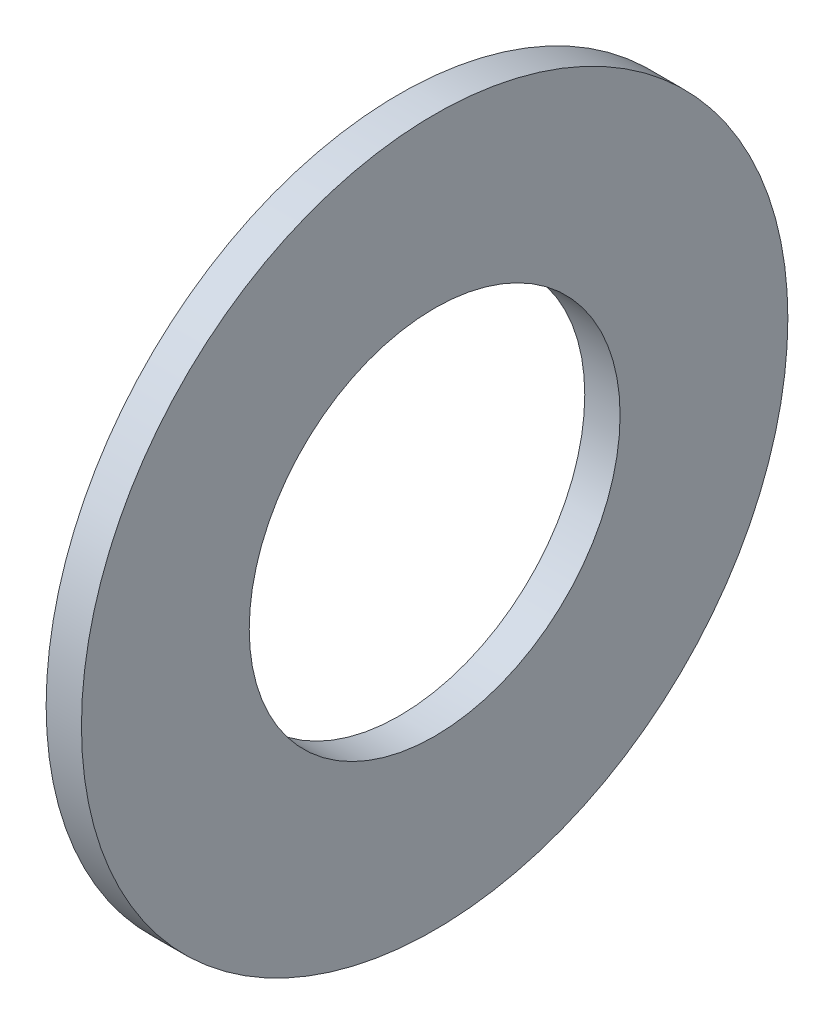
ISO-10303-21;
HEADER;
FILE_DESCRIPTION(('STEP AP214'),'2;1');
FILE_NAME('part.step','',(''),(''),'','','');
FILE_SCHEMA(('AUTOMOTIVE_DESIGN { 1 0 10303 214 1 1 1 1 }'));
ENDSEC;
DATA;
#1=APPLICATION_CONTEXT('core data for automotive mechanical design processes');
#2=APPLICATION_PROTOCOL_DEFINITION('international standard','automotive_design',2000,#1);
#3=PRODUCT_CONTEXT('',#1,'mechanical');
#4=PRODUCT('Part','Part','',(#3));
#5=PRODUCT_RELATED_PRODUCT_CATEGORY('part','',(#4));
#6=PRODUCT_DEFINITION_FORMATION('','',#4);
#7=PRODUCT_DEFINITION_CONTEXT('part definition',#1,'design');
#8=PRODUCT_DEFINITION('design','',#6,#7);
#9=PRODUCT_DEFINITION_SHAPE('','',#8);
#10=(LENGTH_UNIT() NAMED_UNIT(*) SI_UNIT(.MILLI.,.METRE.));
#11=(NAMED_UNIT(*) PLANE_ANGLE_UNIT() SI_UNIT($,.RADIAN.));
#12=(NAMED_UNIT(*) SI_UNIT($,.STERADIAN.) SOLID_ANGLE_UNIT());
#13=UNCERTAINTY_MEASURE_WITH_UNIT(LENGTH_MEASURE(1.E-05),#10,'distance_accuracy_value','');
#14=(GEOMETRIC_REPRESENTATION_CONTEXT(3) GLOBAL_UNCERTAINTY_ASSIGNED_CONTEXT((#13)) GLOBAL_UNIT_ASSIGNED_CONTEXT((#10,
#11,#12)) REPRESENTATION_CONTEXT('',''));
#15=CARTESIAN_POINT('',(0.,0.,0.));
#16=DIRECTION('',(0.,0.,1.));
#17=DIRECTION('',(1.,0.,0.));
#18=AXIS2_PLACEMENT_3D('',#15,#16,#17);
#19=CARTESIAN_POINT('',(0.,0.,-10.));
#20=DIRECTION('',(1.,0.,0.));
#21=DIRECTION('',(0.,0.,-1.));
#22=AXIS2_PLACEMENT_3D('',#19,#20,#21);
#23=PLANE('',#22);
#24=CARTESIAN_POINT('',(0.,0.,0.));
#25=DIRECTION('',(-1.,0.,0.));
#26=DIRECTION('',(0.,0.,1.));
#27=AXIS2_PLACEMENT_3D('',#24,#25,#26);
#28=CIRCLE('',#27,5.25);
#29=CARTESIAN_POINT('',(0.,0.,5.25));
#30=VERTEX_POINT('',#29);
#31=EDGE_CURVE('E10',#30,#30,#28,.T.);
#32=ORIENTED_EDGE('',*,*,#31,.F.);
#33=EDGE_LOOP('',(#32));
#34=FACE_BOUND('',#33,.T.);
#35=CARTESIAN_POINT('',(0.,0.,0.));
#36=DIRECTION('',(-1.,0.,0.));
#37=DIRECTION('',(0.,0.,1.));
#38=AXIS2_PLACEMENT_3D('',#35,#36,#37);
#39=CIRCLE('',#38,10.);
#40=CARTESIAN_POINT('',(0.,0.,10.));
#41=VERTEX_POINT('',#40);
#42=EDGE_CURVE('E48',#41,#41,#39,.T.);
#43=ORIENTED_EDGE('',*,*,#42,.T.);
#44=EDGE_LOOP('',(#43));
#45=FACE_BOUND('',#44,.T.);
#46=ADVANCED_FACE('F34',(#34,#45),#23,.F.);
#47=CARTESIAN_POINT('',(0.,0.,0.));
#48=DIRECTION('',(-1.,0.,0.));
#49=DIRECTION('',(0.,0.,1.));
#50=AXIS2_PLACEMENT_3D('',#47,#48,#49);
#51=CYLINDRICAL_SURFACE('',#50,5.25);
#52=CARTESIAN_POINT('',(1.,0.,0.));
#53=DIRECTION('',(-1.,0.,0.));
#54=DIRECTION('',(0.,0.,1.));
#55=AXIS2_PLACEMENT_3D('',#52,#53,#54);
#56=CIRCLE('',#55,5.25);
#57=CARTESIAN_POINT('',(1.,0.,5.25));
#58=VERTEX_POINT('',#57);
#59=EDGE_CURVE('E40',#58,#58,#56,.T.);
#60=ORIENTED_EDGE('',*,*,#59,.F.);
#61=EDGE_LOOP('',(#60));
#62=FACE_BOUND('',#61,.T.);
#63=ORIENTED_EDGE('',*,*,#31,.T.);
#64=EDGE_LOOP('',(#63));
#65=FACE_BOUND('',#64,.T.);
#66=ADVANCED_FACE('F63',(#62,#65),#51,.F.);
#67=CARTESIAN_POINT('',(1.,0.,-10.));
#68=DIRECTION('',(-1.,0.,0.));
#69=DIRECTION('',(0.,0.,1.));
#70=AXIS2_PLACEMENT_3D('',#67,#68,#69);
#71=PLANE('',#70);
#72=CARTESIAN_POINT('',(1.,0.,0.));
#73=DIRECTION('',(-1.,0.,0.));
#74=DIRECTION('',(0.,0.,1.));
#75=AXIS2_PLACEMENT_3D('',#72,#73,#74);
#76=CIRCLE('',#75,10.);
#77=CARTESIAN_POINT('',(1.,0.,10.));
#78=VERTEX_POINT('',#77);
#79=EDGE_CURVE('E44',#78,#78,#76,.T.);
#80=ORIENTED_EDGE('',*,*,#79,.F.);
#81=EDGE_LOOP('',(#80));
#82=FACE_BOUND('',#81,.T.);
#83=ORIENTED_EDGE('',*,*,#59,.T.);
#84=EDGE_LOOP('',(#83));
#85=FACE_BOUND('',#84,.T.);
#86=ADVANCED_FACE('F58',(#82,#85),#71,.F.);
#87=CARTESIAN_POINT('',(0.,0.,0.));
#88=DIRECTION('',(-1.,0.,0.));
#89=DIRECTION('',(0.,0.,1.));
#90=AXIS2_PLACEMENT_3D('',#87,#88,#89);
#91=CYLINDRICAL_SURFACE('',#90,10.);
#92=ORIENTED_EDGE('',*,*,#42,.F.);
#93=EDGE_LOOP('',(#92));
#94=FACE_BOUND('',#93,.T.);
#95=ORIENTED_EDGE('',*,*,#79,.T.);
#96=EDGE_LOOP('',(#95));
#97=FACE_BOUND('',#96,.T.);
#98=ADVANCED_FACE('F55',(#94,#97),#91,.T.);
#99=CLOSED_SHELL('',(#46,#66,#86,#98));
#100=MANIFOLD_SOLID_BREP('B2',#99);
#101=ADVANCED_BREP_SHAPE_REPRESENTATION('',(#18,#100),#14);
#102=SHAPE_DEFINITION_REPRESENTATION(#9,#101);
ENDSEC;
END-ISO-10303-21;
